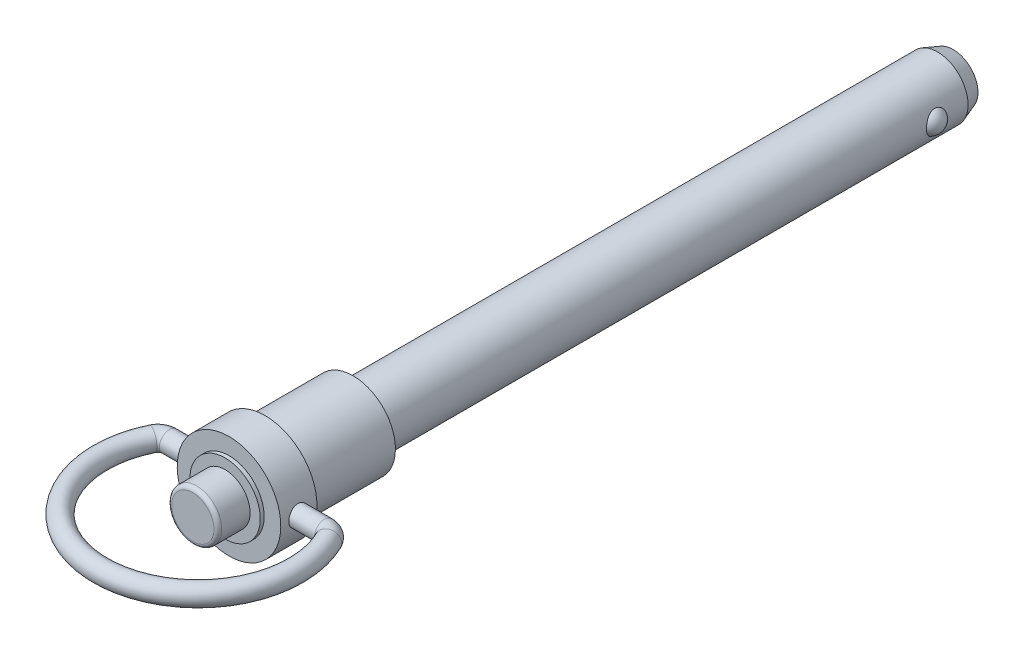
ISO-10303-21;
HEADER;
FILE_DESCRIPTION(('STEP AP214'),'2;1');
FILE_NAME('part.step','',(''),(''),'','','');
FILE_SCHEMA(('AUTOMOTIVE_DESIGN { 1 0 10303 214 1 1 1 1 }'));
ENDSEC;
DATA;
#1=APPLICATION_CONTEXT('core data for automotive mechanical design processes');
#2=APPLICATION_PROTOCOL_DEFINITION('international standard','automotive_design',2000,#1);
#3=PRODUCT_CONTEXT('',#1,'mechanical');
#4=PRODUCT('Part','Part','',(#3));
#5=PRODUCT_RELATED_PRODUCT_CATEGORY('part','',(#4));
#6=PRODUCT_DEFINITION_FORMATION('','',#4);
#7=PRODUCT_DEFINITION_CONTEXT('part definition',#1,'design');
#8=PRODUCT_DEFINITION('design','',#6,#7);
#9=PRODUCT_DEFINITION_SHAPE('','',#8);
#10=(LENGTH_UNIT() NAMED_UNIT(*) SI_UNIT(.MILLI.,.METRE.));
#11=(NAMED_UNIT(*) PLANE_ANGLE_UNIT() SI_UNIT($,.RADIAN.));
#12=(NAMED_UNIT(*) SI_UNIT($,.STERADIAN.) SOLID_ANGLE_UNIT());
#13=UNCERTAINTY_MEASURE_WITH_UNIT(LENGTH_MEASURE(1.E-05),#10,'distance_accuracy_value','');
#14=(GEOMETRIC_REPRESENTATION_CONTEXT(3) GLOBAL_UNCERTAINTY_ASSIGNED_CONTEXT((#13)) GLOBAL_UNIT_ASSIGNED_CONTEXT((#10,
#11,#12)) REPRESENTATION_CONTEXT('',''));
#15=CARTESIAN_POINT('',(0.,0.,0.));
#16=DIRECTION('',(0.,0.,1.));
#17=DIRECTION('',(1.,0.,0.));
#18=AXIS2_PLACEMENT_3D('',#15,#16,#17);
#19=CARTESIAN_POINT('',(0.,0.,20.828));
#20=DIRECTION('',(0.,0.,1.));
#21=DIRECTION('',(0.,-1.,0.));
#22=AXIS2_PLACEMENT_3D('',#19,#20,#21);
#23=PLANE('',#22);
#24=CARTESIAN_POINT('',(0.,0.,20.828));
#25=DIRECTION('',(0.,0.,-1.));
#26=DIRECTION('',(0.,1.,0.));
#27=AXIS2_PLACEMENT_3D('',#24,#25,#26);
#28=CIRCLE('',#27,2.7432);
#29=CARTESIAN_POINT('',(0.,2.7432,20.828));
#30=VERTEX_POINT('',#29);
#31=CARTESIAN_POINT('',(0.,-2.7432,20.828));
#32=VERTEX_POINT('',#31);
#33=EDGE_CURVE('E33',#30,#32,#28,.T.);
#34=ORIENTED_EDGE('',*,*,#33,.F.);
#35=CARTESIAN_POINT('',(0.,0.,20.828));
#36=DIRECTION('',(0.,0.,-1.));
#37=DIRECTION('',(0.,-1.,0.));
#38=AXIS2_PLACEMENT_3D('',#35,#36,#37);
#39=CIRCLE('',#38,2.7432);
#40=EDGE_CURVE('E28',#32,#30,#39,.T.);
#41=ORIENTED_EDGE('',*,*,#40,.F.);
#42=EDGE_LOOP('',(#34,#41));
#43=FACE_BOUND('',#42,.T.);
#44=ADVANCED_FACE('F14',(#43),#23,.T.);
#45=CARTESIAN_POINT('',(0.,0.,20.32));
#46=DIRECTION('',(0.,0.,1.));
#47=DIRECTION('',(0.,-1.,0.));
#48=AXIS2_PLACEMENT_3D('',#45,#46,#47);
#49=TOROIDAL_SURFACE('',#48,2.7432,0.508);
#50=ORIENTED_EDGE('',*,*,#40,.T.);
#51=ORIENTED_EDGE('',*,*,#33,.T.);
#52=EDGE_LOOP('',(#50,#51));
#53=FACE_BOUND('',#52,.T.);
#54=CARTESIAN_POINT('',(0.,0.,20.32));
#55=DIRECTION('',(0.,0.,-1.));
#56=DIRECTION('',(0.,1.,0.));
#57=AXIS2_PLACEMENT_3D('',#54,#55,#56);
#58=CIRCLE('',#57,3.2512);
#59=CARTESIAN_POINT('',(0.,3.2512,20.32));
#60=VERTEX_POINT('',#59);
#61=EDGE_CURVE('E50',#60,#60,#58,.T.);
#62=ORIENTED_EDGE('',*,*,#61,.F.);
#63=EDGE_LOOP('',(#62));
#64=FACE_BOUND('',#63,.T.);
#65=ADVANCED_FACE('F39',(#53,#64),#49,.T.);
#66=CARTESIAN_POINT('',(0.,0.,20.828));
#67=DIRECTION('',(0.,0.,-1.));
#68=DIRECTION('',(0.,1.,0.));
#69=AXIS2_PLACEMENT_3D('',#66,#67,#68);
#70=CYLINDRICAL_SURFACE('',#69,3.2512);
#71=CARTESIAN_POINT('',(0.,0.,16.637));
#72=DIRECTION('',(0.,0.,-1.));
#73=DIRECTION('',(0.,1.,0.));
#74=AXIS2_PLACEMENT_3D('',#71,#72,#73);
#75=CIRCLE('',#74,3.2512);
#76=CARTESIAN_POINT('',(0.,3.2512,16.637));
#77=VERTEX_POINT('',#76);
#78=EDGE_CURVE('E59',#77,#77,#75,.T.);
#79=ORIENTED_EDGE('',*,*,#78,.F.);
#80=EDGE_LOOP('',(#79));
#81=FACE_BOUND('',#80,.T.);
#82=ORIENTED_EDGE('',*,*,#61,.T.);
#83=EDGE_LOOP('',(#82));
#84=FACE_BOUND('',#83,.T.);
#85=ADVANCED_FACE('F79',(#81,#84),#70,.T.);
#86=CARTESIAN_POINT('',(4.572,0.,16.637));
#87=DIRECTION('',(0.,0.,1.));
#88=DIRECTION('',(0.,-1.,0.));
#89=AXIS2_PLACEMENT_3D('',#86,#87,#88);
#90=PLANE('',#89);
#91=ORIENTED_EDGE('',*,*,#78,.T.);
#92=EDGE_LOOP('',(#91));
#93=FACE_BOUND('',#92,.T.);
#94=CARTESIAN_POINT('',(0.,0.,16.637));
#95=DIRECTION('',(0.,0.,-1.));
#96=DIRECTION('',(0.,1.,0.));
#97=AXIS2_PLACEMENT_3D('',#94,#95,#96);
#98=CIRCLE('',#97,4.572);
#99=CARTESIAN_POINT('',(0.,4.572,16.637));
#100=VERTEX_POINT('',#99);
#101=EDGE_CURVE('E63',#100,#100,#98,.T.);
#102=ORIENTED_EDGE('',*,*,#101,.F.);
#103=EDGE_LOOP('',(#102));
#104=FACE_BOUND('',#103,.T.);
#105=ADVANCED_FACE('F82',(#93,#104),#90,.T.);
#106=CARTESIAN_POINT('',(0.,0.,0.));
#107=DIRECTION('',(0.,0.,-1.));
#108=DIRECTION('',(0.,1.,0.));
#109=AXIS2_PLACEMENT_3D('',#106,#107,#108);
#110=CYLINDRICAL_SURFACE('',#109,4.572);
#111=ORIENTED_EDGE('',*,*,#101,.T.);
#112=EDGE_LOOP('',(#111));
#113=FACE_BOUND('',#112,.T.);
#114=CARTESIAN_POINT('',(0.,0.,16.129));
#115=DIRECTION('',(0.,0.,-1.));
#116=DIRECTION('',(0.,1.,0.));
#117=AXIS2_PLACEMENT_3D('',#114,#115,#116);
#118=CIRCLE('',#117,4.572);
#119=CARTESIAN_POINT('',(0.,4.572,16.129));
#120=VERTEX_POINT('',#119);
#121=EDGE_CURVE('E217',#120,#120,#118,.T.);
#122=ORIENTED_EDGE('',*,*,#121,.F.);
#123=EDGE_LOOP('',(#122));
#124=FACE_BOUND('',#123,.T.);
#125=ADVANCED_FACE('F181',(#113,#124),#110,.T.);
#126=CARTESIAN_POINT('',(6.731,0.,16.129));
#127=DIRECTION('',(0.,0.,1.));
#128=DIRECTION('',(0.,-1.,0.));
#129=AXIS2_PLACEMENT_3D('',#126,#127,#128);
#130=PLANE('',#129);
#131=CARTESIAN_POINT('',(0.,0.,16.129));
#132=DIRECTION('',(0.,0.,-1.));
#133=DIRECTION('',(0.,1.,0.));
#134=AXIS2_PLACEMENT_3D('',#131,#132,#133);
#135=CIRCLE('',#134,6.731);
#136=CARTESIAN_POINT('',(0.,6.731,16.129));
#137=VERTEX_POINT('',#136);
#138=EDGE_CURVE('E220',#137,#137,#135,.T.);
#139=ORIENTED_EDGE('',*,*,#138,.F.);
#140=EDGE_LOOP('',(#139));
#141=FACE_BOUND('',#140,.T.);
#142=ORIENTED_EDGE('',*,*,#121,.T.);
#143=EDGE_LOOP('',(#142));
#144=FACE_BOUND('',#143,.T.);
#145=ADVANCED_FACE('F170',(#141,#144),#130,.T.);
#146=CARTESIAN_POINT('',(0.,0.,0.));
#147=DIRECTION('',(0.,0.,-1.));
#148=DIRECTION('',(0.,1.,0.));
#149=AXIS2_PLACEMENT_3D('',#146,#147,#148);
#150=CYLINDRICAL_SURFACE('',#149,6.731);
#151=CARTESIAN_POINT('',(0.,0.,11.43));
#152=DIRECTION('',(0.,0.,-1.));
#153=DIRECTION('',(0.,1.,0.));
#154=AXIS2_PLACEMENT_3D('',#151,#152,#153);
#155=CIRCLE('',#154,6.731);
#156=CARTESIAN_POINT('',(0.,6.731,11.43));
#157=VERTEX_POINT('',#156);
#158=EDGE_CURVE('E222',#157,#157,#155,.T.);
#159=ORIENTED_EDGE('',*,*,#158,.F.);
#160=EDGE_LOOP('',(#159));
#161=FACE_BOUND('',#160,.T.);
#162=ORIENTED_EDGE('',*,*,#138,.T.);
#163=EDGE_LOOP('',(#162));
#164=FACE_BOUND('',#163,.T.);
#165=CARTESIAN_POINT('',(-6.6051722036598,1.2954,13.7922));
#166=CARTESIAN_POINT('',(-6.60517361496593,1.2953972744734,13.864236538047));
#167=CARTESIAN_POINT('',(-6.60636346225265,1.28937073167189,13.9363080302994));
#168=CARTESIAN_POINT('',(-6.61098794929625,1.26544153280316,14.0784162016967));
#169=CARTESIAN_POINT('',(-6.61442445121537,1.24752902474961,14.1484511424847));
#170=CARTESIAN_POINT('',(-6.62313895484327,1.20040052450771,14.2844095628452));
#171=CARTESIAN_POINT('',(-6.62841519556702,1.17119533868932,14.3503369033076));
#172=CARTESIAN_POINT('',(-6.64021258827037,1.10233951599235,14.4763528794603));
#173=CARTESIAN_POINT('',(-6.64673365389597,1.06268960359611,14.5364419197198));
#174=CARTESIAN_POINT('',(-6.66038139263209,0.973516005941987,14.6498669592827));
#175=CARTESIAN_POINT('',(-6.66751428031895,0.9238817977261,14.7031153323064));
#176=CARTESIAN_POINT('',(-6.68152715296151,0.816387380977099,14.8005834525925));
#177=CARTESIAN_POINT('',(-6.6884071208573,0.758526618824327,14.8448025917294));
#178=CARTESIAN_POINT('',(-6.7012057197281,0.635644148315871,14.9232944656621));
#179=CARTESIAN_POINT('',(-6.70711617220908,0.570568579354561,14.9574843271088));
#180=CARTESIAN_POINT('',(-6.71724013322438,0.435464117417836,15.014412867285));
#181=CARTESIAN_POINT('',(-6.72145378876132,0.365435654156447,15.0371525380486));
#182=CARTESIAN_POINT('',(-6.72766549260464,0.223321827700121,15.0702635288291));
#183=CARTESIAN_POINT('',(-6.72968999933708,0.151272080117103,15.0807826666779));
#184=CARTESIAN_POINT('',(-6.73138656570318,0.00640388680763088,15.089614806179));
#185=CARTESIAN_POINT('',(-6.73105883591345,-0.0664144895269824,15.0879289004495));
#186=CARTESIAN_POINT('',(-6.72810846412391,-0.209738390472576,15.072511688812));
#187=CARTESIAN_POINT('',(-6.72551615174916,-0.280261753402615,15.0589395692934));
#188=CARTESIAN_POINT('',(-6.71836197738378,-0.418011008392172,15.0203872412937));
#189=CARTESIAN_POINT('',(-6.71380004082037,-0.485236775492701,14.9954066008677));
#190=CARTESIAN_POINT('',(-6.70316878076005,-0.614941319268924,14.9345963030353));
#191=CARTESIAN_POINT('',(-6.69709072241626,-0.67738974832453,14.8987035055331));
#192=CARTESIAN_POINT('',(-6.68409856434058,-0.795436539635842,14.8171343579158));
#193=CARTESIAN_POINT('',(-6.677184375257,-0.851034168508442,14.7714569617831));
#194=CARTESIAN_POINT('',(-6.66315320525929,-0.954744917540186,14.6707395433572));
#195=CARTESIAN_POINT('',(-6.65603475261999,-1.00272266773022,14.6155602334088));
#196=CARTESIAN_POINT('',(-6.64250376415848,-1.08876420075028,14.4978679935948));
#197=CARTESIAN_POINT('',(-6.63609123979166,-1.12682782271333,14.4353549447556));
#198=CARTESIAN_POINT('',(-6.62469571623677,-1.19200234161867,14.3045844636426));
#199=CARTESIAN_POINT('',(-6.61971540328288,-1.21909269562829,14.2363165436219));
#200=CARTESIAN_POINT('',(-6.61178862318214,-1.26138008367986,14.0960804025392));
#201=CARTESIAN_POINT('',(-6.60884191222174,-1.27657854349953,14.0241126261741));
#202=CARTESIAN_POINT('',(-6.60536444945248,-1.29445125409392,13.8797427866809));
#203=CARTESIAN_POINT('',(-6.60479610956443,-1.29732037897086,13.8073657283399));
#204=CARTESIAN_POINT('',(-6.60603903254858,-1.29097613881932,13.6631669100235));
#205=CARTESIAN_POINT('',(-6.60785017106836,-1.28176340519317,13.5913451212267));
#206=CARTESIAN_POINT('',(-6.6136128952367,-1.25168453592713,13.4509418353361));
#207=CARTESIAN_POINT('',(-6.61754556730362,-1.23092132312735,13.3823374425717));
#208=CARTESIAN_POINT('',(-6.62709183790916,-1.17844042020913,13.249581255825));
#209=CARTESIAN_POINT('',(-6.63270556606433,-1.14672188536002,13.1854298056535));
#210=CARTESIAN_POINT('',(-6.6450665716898,-1.07278507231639,13.0625442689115));
#211=CARTESIAN_POINT('',(-6.65182676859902,-1.03044414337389,13.0038853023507));
#212=CARTESIAN_POINT('',(-6.66568301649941,-0.936629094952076,12.8944341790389));
#213=CARTESIAN_POINT('',(-6.67277909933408,-0.885154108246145,12.8436427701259));
#214=CARTESIAN_POINT('',(-6.68662882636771,-0.773660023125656,12.7506362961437));
#215=CARTESIAN_POINT('',(-6.69337621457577,-0.713530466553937,12.7085525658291));
#216=CARTESIAN_POINT('',(-6.70566168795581,-0.586941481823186,12.6350847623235));
#217=CARTESIAN_POINT('',(-6.71119982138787,-0.520482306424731,12.6037002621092));
#218=CARTESIAN_POINT('',(-6.72041595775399,-0.383476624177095,12.5527164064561));
#219=CARTESIAN_POINT('',(-6.72410395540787,-0.312954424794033,12.5330536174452));
#220=CARTESIAN_POINT('',(-6.72924701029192,-0.169530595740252,12.5058694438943));
#221=CARTESIAN_POINT('',(-6.7307023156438,-0.0966292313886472,12.4983467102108));
#222=CARTESIAN_POINT('',(-6.73121071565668,0.0482259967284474,12.4957052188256));
#223=CARTESIAN_POINT('',(-6.73030215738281,0.120176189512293,12.5003884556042));
#224=CARTESIAN_POINT('',(-6.72626496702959,0.26224403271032,12.5215909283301));
#225=CARTESIAN_POINT('',(-6.72313635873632,0.332361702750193,12.5381100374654));
#226=CARTESIAN_POINT('',(-6.71501101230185,0.468662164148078,12.5824301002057));
#227=CARTESIAN_POINT('',(-6.710017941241,0.534852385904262,12.6102089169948));
#228=CARTESIAN_POINT('',(-6.69870305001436,0.661661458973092,12.6762356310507));
#229=CARTESIAN_POINT('',(-6.69238113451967,0.722279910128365,12.7144842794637));
#230=CARTESIAN_POINT('',(-6.6789853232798,0.837208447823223,12.8010411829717));
#231=CARTESIAN_POINT('',(-6.67190155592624,0.891410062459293,12.8494919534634));
#232=CARTESIAN_POINT('',(-6.65784127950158,0.990982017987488,12.95478313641));
#233=CARTESIAN_POINT('',(-6.65086479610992,1.03635027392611,13.0116255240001));
#234=CARTESIAN_POINT('',(-6.63773378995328,1.11738877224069,13.1327559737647));
#235=CARTESIAN_POINT('',(-6.63158802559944,1.15295925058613,13.1971117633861));
#236=CARTESIAN_POINT('',(-6.62092027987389,1.21272619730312,13.3309847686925));
#237=CARTESIAN_POINT('',(-6.61639678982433,1.23693323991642,13.4004971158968));
#238=CARTESIAN_POINT('',(-6.61041337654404,1.26845390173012,13.5238636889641));
#239=CARTESIAN_POINT('',(-6.60845980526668,1.27854107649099,13.57700269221));
#240=CARTESIAN_POINT('',(-6.60583870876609,1.29201504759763,13.6841545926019));
#241=CARTESIAN_POINT('',(-6.60517114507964,1.29540204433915,13.7381674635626));
#242=CARTESIAN_POINT('',(-6.6051722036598,1.2954,13.7922));
#243=B_SPLINE_CURVE_WITH_KNOTS('',3,(#165,#166,#167,#168,#169,#170,#171,#172,#173,#174,#175,
#176,#177,#178,#179,#180,#181,#182,#183,#184,#185,#186,#187,#188,#189,#190,#191,#192,#193,#194,
#195,#196,#197,#198,#199,#200,#201,#202,#203,#204,#205,#206,#207,#208,#209,#210,#211,#212,#213,
#214,#215,#216,#217,#218,#219,#220,#221,#222,#223,#224,#225,#226,#227,#228,#229,#230,#231,#232,
#233,#234,#235,#236,#237,#238,#239,#240,#241,#242),.UNSPECIFIED.,.T.,.F.,(4,2,2,2,2,2,2,2,2,2,2,
2,2,2,2,2,2,2,2,2,2,2,2,2,2,2,2,2,2,2,2,2,2,2,2,2,2,2,4),(0.,0.215911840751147,
0.432002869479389,0.64788762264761,0.86375740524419,1.08216318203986,1.30058366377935,
1.52076118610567,1.74091962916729,1.95838638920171,2.1758336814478,2.39041258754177,
2.60499961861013,2.82085272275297,3.0367289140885,3.25609136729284,3.47545737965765,
3.69523218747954,3.91498064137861,4.13124273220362,4.34749352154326,4.56184753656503,
4.7762180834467,4.99318797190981,5.21017847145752,5.430235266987,5.65028327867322,
5.86912939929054,6.08795119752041,6.30324544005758,6.51853737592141,6.73340808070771,
6.94829420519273,7.16640910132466,7.38457541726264,7.60488731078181,7.82499378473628,
7.9869478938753,8.14889715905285),.UNSPECIFIED.);
#244=CARTESIAN_POINT('',(-6.6051722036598,1.2954,13.7922));
#245=VERTEX_POINT('',#244);
#246=EDGE_CURVE('E191',#245,#245,#243,.T.);
#247=ORIENTED_EDGE('',*,*,#246,.T.);
#248=EDGE_LOOP('',(#247));
#249=FACE_BOUND('',#248,.T.);
#250=CARTESIAN_POINT('',(6.6051722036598,1.2954,13.7922));
#251=CARTESIAN_POINT('',(6.60517361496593,1.2953972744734,13.720163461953));
#252=CARTESIAN_POINT('',(6.60636346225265,1.2893707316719,13.6480919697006));
#253=CARTESIAN_POINT('',(6.61098794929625,1.26544153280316,13.5059837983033));
#254=CARTESIAN_POINT('',(6.61442445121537,1.24752902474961,13.4359488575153));
#255=CARTESIAN_POINT('',(6.62313895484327,1.20040052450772,13.2999904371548));
#256=CARTESIAN_POINT('',(6.62841519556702,1.17119533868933,13.2340630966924));
#257=CARTESIAN_POINT('',(6.64021258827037,1.10233951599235,13.1080471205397));
#258=CARTESIAN_POINT('',(6.64673365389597,1.06268960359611,13.0479580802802));
#259=CARTESIAN_POINT('',(6.66038139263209,0.973516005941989,12.9345330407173));
#260=CARTESIAN_POINT('',(6.66751428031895,0.923881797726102,12.8812846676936));
#261=CARTESIAN_POINT('',(6.68152715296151,0.816387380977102,12.7838165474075));
#262=CARTESIAN_POINT('',(6.6884071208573,0.758526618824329,12.7395974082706));
#263=CARTESIAN_POINT('',(6.7012057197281,0.635644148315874,12.6611055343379));
#264=CARTESIAN_POINT('',(6.70711617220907,0.570568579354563,12.6269156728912));
#265=CARTESIAN_POINT('',(6.71724013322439,0.435464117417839,12.569987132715));
#266=CARTESIAN_POINT('',(6.72145378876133,0.36543565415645,12.5472474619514));
#267=CARTESIAN_POINT('',(6.72766549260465,0.223321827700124,12.5141364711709));
#268=CARTESIAN_POINT('',(6.72968999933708,0.151272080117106,12.5036173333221));
#269=CARTESIAN_POINT('',(6.73138656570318,0.00640388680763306,12.494785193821));
#270=CARTESIAN_POINT('',(6.73105883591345,-0.0664144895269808,12.4964710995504));
#271=CARTESIAN_POINT('',(6.72810846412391,-0.209738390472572,12.511888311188));
#272=CARTESIAN_POINT('',(6.72551615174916,-0.280261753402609,12.5254604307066));
#273=CARTESIAN_POINT('',(6.71836197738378,-0.418011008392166,12.5640127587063));
#274=CARTESIAN_POINT('',(6.71380004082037,-0.4852367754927,12.5889933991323));
#275=CARTESIAN_POINT('',(6.70316878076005,-0.614941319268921,12.6498036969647));
#276=CARTESIAN_POINT('',(6.69709072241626,-0.67738974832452,12.6856964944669));
#277=CARTESIAN_POINT('',(6.68409856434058,-0.795436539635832,12.7672656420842));
#278=CARTESIAN_POINT('',(6.677184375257,-0.851034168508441,12.8129430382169));
#279=CARTESIAN_POINT('',(6.66315320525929,-0.954744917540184,12.9136604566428));
#280=CARTESIAN_POINT('',(6.65603475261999,-1.00272266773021,12.9688397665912));
#281=CARTESIAN_POINT('',(6.64250376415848,-1.08876420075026,13.0865320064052));
#282=CARTESIAN_POINT('',(6.63609123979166,-1.12682782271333,13.1490450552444));
#283=CARTESIAN_POINT('',(6.62469571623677,-1.19200234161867,13.2798155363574));
#284=CARTESIAN_POINT('',(6.61971540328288,-1.21909269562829,13.3480834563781));
#285=CARTESIAN_POINT('',(6.61178862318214,-1.26138008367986,13.4883195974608));
#286=CARTESIAN_POINT('',(6.60884191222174,-1.27657854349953,13.5602873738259));
#287=CARTESIAN_POINT('',(6.60536444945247,-1.29445125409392,13.7046572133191));
#288=CARTESIAN_POINT('',(6.60479610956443,-1.29732037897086,13.7770342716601));
#289=CARTESIAN_POINT('',(6.60603903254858,-1.29097613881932,13.9212330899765));
#290=CARTESIAN_POINT('',(6.60785017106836,-1.28176340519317,13.9930548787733));
#291=CARTESIAN_POINT('',(6.6136128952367,-1.25168453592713,14.1334581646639));
#292=CARTESIAN_POINT('',(6.61754556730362,-1.23092132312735,14.2020625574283));
#293=CARTESIAN_POINT('',(6.62709183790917,-1.17844042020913,14.334818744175));
#294=CARTESIAN_POINT('',(6.63270556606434,-1.14672188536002,14.3989701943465));
#295=CARTESIAN_POINT('',(6.64506657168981,-1.07278507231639,14.5218557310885));
#296=CARTESIAN_POINT('',(6.65182676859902,-1.03044414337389,14.5805146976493));
#297=CARTESIAN_POINT('',(6.66568301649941,-0.936629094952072,14.6899658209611));
#298=CARTESIAN_POINT('',(6.67277909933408,-0.885154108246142,14.7407572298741));
#299=CARTESIAN_POINT('',(6.68662882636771,-0.773660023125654,14.8337637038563));
#300=CARTESIAN_POINT('',(6.69337621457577,-0.713530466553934,14.8758474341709));
#301=CARTESIAN_POINT('',(6.70566168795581,-0.586941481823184,14.9493152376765));
#302=CARTESIAN_POINT('',(6.71119982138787,-0.520482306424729,14.9806997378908));
#303=CARTESIAN_POINT('',(6.72041595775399,-0.383476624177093,15.0316835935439));
#304=CARTESIAN_POINT('',(6.72410395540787,-0.31295442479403,15.0513463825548));
#305=CARTESIAN_POINT('',(6.72924701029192,-0.169530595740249,15.0785305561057));
#306=CARTESIAN_POINT('',(6.7307023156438,-0.0966292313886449,15.0860532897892));
#307=CARTESIAN_POINT('',(6.73121071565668,0.0482259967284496,15.0886947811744));
#308=CARTESIAN_POINT('',(6.73030215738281,0.120176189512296,15.0840115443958));
#309=CARTESIAN_POINT('',(6.72626496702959,0.262244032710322,15.0628090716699));
#310=CARTESIAN_POINT('',(6.72313635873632,0.332361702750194,15.0462899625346));
#311=CARTESIAN_POINT('',(6.71501101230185,0.46866216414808,15.0019698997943));
#312=CARTESIAN_POINT('',(6.710017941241,0.534852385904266,14.9741910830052));
#313=CARTESIAN_POINT('',(6.69870305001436,0.661661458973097,14.9081643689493));
#314=CARTESIAN_POINT('',(6.69238113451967,0.722279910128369,14.8699157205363));
#315=CARTESIAN_POINT('',(6.6789853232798,0.837208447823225,14.7833588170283));
#316=CARTESIAN_POINT('',(6.67190155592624,0.891410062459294,14.7349080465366));
#317=CARTESIAN_POINT('',(6.65784127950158,0.990982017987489,14.62961686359));
#318=CARTESIAN_POINT('',(6.65086479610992,1.03635027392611,14.5727744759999));
#319=CARTESIAN_POINT('',(6.63773378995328,1.1173887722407,14.4516440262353));
#320=CARTESIAN_POINT('',(6.63158802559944,1.15295925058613,14.3872882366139));
#321=CARTESIAN_POINT('',(6.62092027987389,1.21272619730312,14.2534152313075));
#322=CARTESIAN_POINT('',(6.61639678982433,1.23693323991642,14.1839028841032));
#323=CARTESIAN_POINT('',(6.61041337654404,1.26845390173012,14.0605363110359));
#324=CARTESIAN_POINT('',(6.60845980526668,1.27854107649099,14.00739730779));
#325=CARTESIAN_POINT('',(6.60583870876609,1.29201504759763,13.9002454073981));
#326=CARTESIAN_POINT('',(6.60517114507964,1.29540204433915,13.8462325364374));
#327=CARTESIAN_POINT('',(6.6051722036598,1.2954,13.7922));
#328=B_SPLINE_CURVE_WITH_KNOTS('',3,(#250,#251,#252,#253,#254,#255,#256,#257,#258,#259,#260,
#261,#262,#263,#264,#265,#266,#267,#268,#269,#270,#271,#272,#273,#274,#275,#276,#277,#278,#279,
#280,#281,#282,#283,#284,#285,#286,#287,#288,#289,#290,#291,#292,#293,#294,#295,#296,#297,#298,
#299,#300,#301,#302,#303,#304,#305,#306,#307,#308,#309,#310,#311,#312,#313,#314,#315,#316,#317,
#318,#319,#320,#321,#322,#323,#324,#325,#326,#327),.UNSPECIFIED.,.T.,.F.,(4,2,2,2,2,2,2,2,2,2,2,
2,2,2,2,2,2,2,2,2,2,2,2,2,2,2,2,2,2,2,2,2,2,2,2,2,2,2,4),(0.,0.215911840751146,
0.432002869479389,0.64788762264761,0.86375740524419,1.08216318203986,1.30058366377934,
1.52076118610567,1.74091962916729,1.95838638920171,2.1758336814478,2.39041258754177,
2.60499961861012,2.82085272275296,3.0367289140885,3.25609136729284,3.47545737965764,
3.69523218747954,3.91498064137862,4.13124273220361,4.34749352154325,4.56184753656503,
4.77621808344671,4.99318797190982,5.21017847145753,5.43023526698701,5.65028327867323,
5.86912939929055,6.08795119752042,6.30324544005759,6.51853737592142,6.73340808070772,
6.94829420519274,7.16640910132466,7.38457541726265,7.60488731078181,7.82499378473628,
7.98694789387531,8.14889715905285),.UNSPECIFIED.);
#329=CARTESIAN_POINT('',(6.6051722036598,1.2954,13.7922));
#330=VERTEX_POINT('',#329);
#331=EDGE_CURVE('E198',#330,#330,#328,.T.);
#332=ORIENTED_EDGE('',*,*,#331,.T.);
#333=EDGE_LOOP('',(#332));
#334=FACE_BOUND('',#333,.T.);
#335=ADVANCED_FACE('F164',(#161,#164,#249,#334),#150,.T.);
#336=CARTESIAN_POINT('',(5.7785,0.,11.43));
#337=DIRECTION('',(0.,0.,-1.));
#338=DIRECTION('',(0.,1.,0.));
#339=AXIS2_PLACEMENT_3D('',#336,#337,#338);
#340=PLANE('',#339);
#341=CARTESIAN_POINT('',(0.,0.,11.43));
#342=DIRECTION('',(0.,0.,-1.));
#343=DIRECTION('',(0.,1.,0.));
#344=AXIS2_PLACEMENT_3D('',#341,#342,#343);
#345=CIRCLE('',#344,5.9);
#346=CARTESIAN_POINT('',(0.,5.9,11.43));
#347=VERTEX_POINT('',#346);
#348=EDGE_CURVE('E22',#347,#347,#345,.F.);
#349=ORIENTED_EDGE('',*,*,#348,.T.);
#350=EDGE_LOOP('',(#349));
#351=FACE_BOUND('',#350,.T.);
#352=ORIENTED_EDGE('',*,*,#158,.T.);
#353=EDGE_LOOP('',(#352));
#354=FACE_BOUND('',#353,.T.);
#355=ADVANCED_FACE('F87',(#351,#354),#340,.T.);
#356=CARTESIAN_POINT('',(10.0803124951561,0.,15.3162));
#357=DIRECTION('',(0.,1.,0.));
#358=DIRECTION('',(-1.,0.,0.));
#359=AXIS2_PLACEMENT_3D('',#356,#357,#358);
#360=TOROIDAL_SURFACE('',#359,1.524,1.2954);
#361=CARTESIAN_POINT('',(11.4549005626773,0.,14.658109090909));
#362=DIRECTION('',(-0.431818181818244,0.,-0.901960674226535));
#363=DIRECTION('',(0.901960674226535,0.,-0.431818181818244));
#364=AXIS2_PLACEMENT_3D('',#361,#362,#363);
#365=CIRCLE('',#364,1.2954);
#366=CARTESIAN_POINT('',(12.6233004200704,0.,14.0987318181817));
#367=VERTEX_POINT('',#366);
#368=EDGE_CURVE('E41',#367,#367,#365,.T.);
#369=ORIENTED_EDGE('',*,*,#368,.T.);
#370=EDGE_LOOP('',(#369));
#371=FACE_BOUND('',#370,.T.);
#372=CARTESIAN_POINT('',(10.0803124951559,0.,13.7922));
#373=DIRECTION('',(1.,0.,0.));
#374=DIRECTION('',(0.,1.,0.));
#375=AXIS2_PLACEMENT_3D('',#372,#373,#374);
#376=CIRCLE('',#375,1.2954);
#377=CARTESIAN_POINT('',(10.0803124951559,1.2954,13.7922));
#378=VERTEX_POINT('',#377);
#379=EDGE_CURVE('E56',#378,#378,#376,.F.);
#380=ORIENTED_EDGE('',*,*,#379,.F.);
#381=EDGE_LOOP('',(#380));
#382=FACE_BOUND('',#381,.T.);
#383=ADVANCED_FACE('F84',(#371,#382),#360,.T.);
#384=CARTESIAN_POINT('',(-10.0803124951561,0.,13.7922));
#385=DIRECTION('',(1.,0.,0.));
#386=DIRECTION('',(0.,1.,0.));
#387=AXIS2_PLACEMENT_3D('',#384,#385,#386);
#388=CYLINDRICAL_SURFACE('',#387,1.2954);
#389=ORIENTED_EDGE('',*,*,#331,.F.);
#390=EDGE_LOOP('',(#389));
#391=FACE_BOUND('',#390,.T.);
#392=ORIENTED_EDGE('',*,*,#379,.T.);
#393=EDGE_LOOP('',(#392));
#394=FACE_BOUND('',#393,.T.);
#395=ADVANCED_FACE('F76',(#391,#394),#388,.T.);
#396=CARTESIAN_POINT('',(0.,0.,20.1422));
#397=DIRECTION('',(0.,1.,0.));
#398=DIRECTION('',(-1.,0.,0.));
#399=AXIS2_PLACEMENT_3D('',#396,#397,#398);
#400=TOROIDAL_SURFACE('',#399,12.7,1.2954);
#401=CARTESIAN_POINT('',(-11.4549005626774,0.,14.6581090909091));
#402=DIRECTION('',(-0.43181818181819,0.,0.901960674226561));
#403=DIRECTION('',(-0.901960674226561,0.,-0.43181818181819));
#404=AXIS2_PLACEMENT_3D('',#401,#402,#403);
#405=CIRCLE('',#404,1.2954);
#406=CARTESIAN_POINT('',(-12.6233004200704,0.,14.0987318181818));
#407=VERTEX_POINT('',#406);
#408=EDGE_CURVE('E53',#407,#407,#405,.F.);
#409=ORIENTED_EDGE('',*,*,#408,.F.);
#410=EDGE_LOOP('',(#409));
#411=FACE_BOUND('',#410,.T.);
#412=ORIENTED_EDGE('',*,*,#368,.F.);
#413=EDGE_LOOP('',(#412));
#414=FACE_BOUND('',#413,.T.);
#415=ADVANCED_FACE('F74',(#411,#414),#400,.T.);
#416=CARTESIAN_POINT('',(-10.0803124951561,0.,15.3162));
#417=DIRECTION('',(0.,1.,0.));
#418=DIRECTION('',(-1.,0.,0.));
#419=AXIS2_PLACEMENT_3D('',#416,#417,#418);
#420=TOROIDAL_SURFACE('',#419,1.524,1.2954);
#421=CARTESIAN_POINT('',(-10.0803124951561,0.,13.7922));
#422=DIRECTION('',(1.,0.,0.));
#423=DIRECTION('',(0.,1.,0.));
#424=AXIS2_PLACEMENT_3D('',#421,#422,#423);
#425=CIRCLE('',#424,1.2954);
#426=CARTESIAN_POINT('',(-10.0803124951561,1.2954,13.7922));
#427=VERTEX_POINT('',#426);
#428=EDGE_CURVE('E60',#427,#427,#425,.T.);
#429=ORIENTED_EDGE('',*,*,#428,.F.);
#430=EDGE_LOOP('',(#429));
#431=FACE_BOUND('',#430,.T.);
#432=ORIENTED_EDGE('',*,*,#408,.T.);
#433=EDGE_LOOP('',(#432));
#434=FACE_BOUND('',#433,.T.);
#435=ADVANCED_FACE('F69',(#431,#434),#420,.T.);
#436=CARTESIAN_POINT('',(-10.0803124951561,0.,13.7922));
#437=DIRECTION('',(1.,0.,0.));
#438=DIRECTION('',(0.,1.,0.));
#439=AXIS2_PLACEMENT_3D('',#436,#437,#438);
#440=CYLINDRICAL_SURFACE('',#439,1.2954);
#441=ORIENTED_EDGE('',*,*,#246,.F.);
#442=EDGE_LOOP('',(#441));
#443=FACE_BOUND('',#442,.T.);
#444=ORIENTED_EDGE('',*,*,#428,.T.);
#445=EDGE_LOOP('',(#444));
#446=FACE_BOUND('',#445,.T.);
#447=ADVANCED_FACE('F73',(#443,#446),#440,.T.);
#448=CARTESIAN_POINT('',(0.,0.,39.7572114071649));
#449=DIRECTION('',(0.,0.,-1.));
#450=DIRECTION('',(0.,1.,0.));
#451=AXIS2_PLACEMENT_3D('',#448,#449,#450);
#452=CYLINDRICAL_SURFACE('',#451,5.5);
#453=CARTESIAN_POINT('',(0.,0.,11.03));
#454=DIRECTION('',(0.,0.,-1.));
#455=DIRECTION('',(0.,1.,0.));
#456=AXIS2_PLACEMENT_3D('',#453,#454,#455);
#457=CIRCLE('',#456,5.5);
#458=CARTESIAN_POINT('',(0.,5.5,11.03));
#459=VERTEX_POINT('',#458);
#460=EDGE_CURVE('E9',#459,#459,#457,.T.);
#461=ORIENTED_EDGE('',*,*,#460,.T.);
#462=EDGE_LOOP('',(#461));
#463=FACE_BOUND('',#462,.T.);
#464=CARTESIAN_POINT('',(0.,0.,0.));
#465=DIRECTION('',(0.,0.,-1.));
#466=DIRECTION('',(0.,1.,0.));
#467=AXIS2_PLACEMENT_3D('',#464,#465,#466);
#468=CIRCLE('',#467,5.5);
#469=CARTESIAN_POINT('',(0.,5.5,0.));
#470=VERTEX_POINT('',#469);
#471=EDGE_CURVE('E199',#470,#470,#468,.T.);
#472=ORIENTED_EDGE('',*,*,#471,.F.);
#473=EDGE_LOOP('',(#472));
#474=FACE_BOUND('',#473,.T.);
#475=ADVANCED_FACE('F188',(#463,#474),#452,.T.);
#476=CARTESIAN_POINT('',(3.22979748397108,0.,-77.9908));
#477=DIRECTION('',(0.,0.,1.));
#478=DIRECTION('',(0.,-1.,0.));
#479=AXIS2_PLACEMENT_3D('',#476,#477,#478);
#480=PLANE('',#479);
#481=CARTESIAN_POINT('',(0.,0.,-77.9907999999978));
#482=DIRECTION('',(0.,0.,1.));
#483=DIRECTION('',(0.,-1.,0.));
#484=AXIS2_PLACEMENT_3D('',#481,#482,#483);
#485=CIRCLE('',#484,3.22979748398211);
#486=CARTESIAN_POINT('',(0.,-3.22979748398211,-77.9907999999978));
#487=VERTEX_POINT('',#486);
#488=EDGE_CURVE('E119',#487,#487,#485,.T.);
#489=ORIENTED_EDGE('',*,*,#488,.F.);
#490=EDGE_LOOP('',(#489));
#491=FACE_BOUND('',#490,.T.);
#492=ADVANCED_FACE('F130',(#491),#480,.F.);
#493=CARTESIAN_POINT('',(3.12293,0.,-71.8948));
#494=DIRECTION('',(0.,0.,1.));
#495=DIRECTION('',(1.,0.,0.));
#496=AXIS2_PLACEMENT_3D('',#493,#494,#495);
#497=SPHERICAL_SURFACE('',#496,1.5875);
#498=CARTESIAN_POINT('',(3.969385,0.,-70.5517921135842));
#499=CARTESIAN_POINT('',(3.96938133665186,0.0871787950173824,-70.5517940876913));
#500=CARTESIAN_POINT('',(3.96648576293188,0.174428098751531,-70.5584820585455));
#501=CARTESIAN_POINT('',(3.95516905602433,0.346584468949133,-70.5851998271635));
#502=CARTESIAN_POINT('',(3.94674017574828,0.431488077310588,-70.6052483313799));
#503=CARTESIAN_POINT('',(3.92519423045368,0.596479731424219,-70.6585272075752));
#504=CARTESIAN_POINT('',(3.91207555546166,0.676566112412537,-70.6917621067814));
#505=CARTESIAN_POINT('',(3.88253654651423,0.829452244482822,-70.7710588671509));
#506=CARTESIAN_POINT('',(3.86611699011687,0.902253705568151,-70.8171177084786));
#507=CARTESIAN_POINT('',(3.83222363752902,1.03672093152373,-70.9203356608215));
#508=CARTESIAN_POINT('',(3.81477966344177,1.0985904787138,-70.9772380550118));
#509=CARTESIAN_POINT('',(3.78068495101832,1.21073548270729,-71.1017462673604));
#510=CARTESIAN_POINT('',(3.76403384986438,1.26101628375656,-71.1693471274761));
#511=CARTESIAN_POINT('',(3.73507217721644,1.34426479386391,-71.3077911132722));
#512=CARTESIAN_POINT('',(3.72252093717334,1.37829571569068,-71.3779422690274));
#513=CARTESIAN_POINT('',(3.70178973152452,1.43305274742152,-71.5238520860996));
#514=CARTESIAN_POINT('',(3.69360549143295,1.45379187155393,-71.5996051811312));
#515=CARTESIAN_POINT('',(3.68341966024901,1.47939277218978,-71.7454817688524));
#516=CARTESIAN_POINT('',(3.680835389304,1.4857542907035,-71.8153038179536));
#517=CARTESIAN_POINT('',(3.68040725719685,1.48681628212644,-71.9550414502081));
#518=CARTESIAN_POINT('',(3.68256179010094,1.48152070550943,-72.0249569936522));
#519=CARTESIAN_POINT('',(3.69108766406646,1.4601393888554,-72.1588086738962));
#520=CARTESIAN_POINT('',(3.69721728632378,1.44467149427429,-72.2228608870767));
#521=CARTESIAN_POINT('',(3.71278611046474,1.40417367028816,-72.3474287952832));
#522=CARTESIAN_POINT('',(3.72222570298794,1.37914261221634,-72.4079440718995));
#523=CARTESIAN_POINT('',(3.74389633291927,1.3192072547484,-72.5264268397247));
#524=CARTESIAN_POINT('',(3.75622345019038,1.28394990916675,-72.5841973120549));
#525=CARTESIAN_POINT('',(3.78224213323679,1.20514746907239,-72.6934181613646));
#526=CARTESIAN_POINT('',(3.79593412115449,1.1615998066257,-72.7448665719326));
#527=CARTESIAN_POINT('',(3.82484228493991,1.06277839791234,-72.8454045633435));
#528=CARTESIAN_POINT('',(3.84007638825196,1.00677387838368,-72.8937694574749));
#529=CARTESIAN_POINT('',(3.86933265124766,0.887713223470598,-72.9813922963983));
#530=CARTESIAN_POINT('',(3.88335410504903,0.824653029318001,-73.0206449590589));
#531=CARTESIAN_POINT('',(3.90318345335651,0.722863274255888,-73.0740110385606));
#532=CARTESIAN_POINT('',(3.90984058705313,0.686009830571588,-73.0914710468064));
#533=CARTESIAN_POINT('',(3.92226926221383,0.610957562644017,-73.1234767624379));
#534=CARTESIAN_POINT('',(3.92804156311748,0.572759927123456,-73.1380249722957));
#535=CARTESIAN_POINT('',(3.94381689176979,0.456514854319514,-73.1772484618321));
#536=CARTESIAN_POINT('',(3.95229851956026,0.376714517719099,-73.1975549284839));
#537=CARTESIAN_POINT('',(3.96199329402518,0.247044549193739,-73.2205332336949));
#538=CARTESIAN_POINT('',(3.96475587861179,0.197910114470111,-73.2270073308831));
#539=CARTESIAN_POINT('',(3.96845279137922,0.0991914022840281,-73.2356452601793));
#540=CARTESIAN_POINT('',(3.96938708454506,0.0496071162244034,-73.2378090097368));
#541=CARTESIAN_POINT('',(3.96938133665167,-0.0871787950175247,-73.2378059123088));
#542=CARTESIAN_POINT('',(3.96648576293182,-0.174428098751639,-73.2311179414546));
#543=CARTESIAN_POINT('',(3.95516905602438,-0.346584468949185,-73.2044001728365));
#544=CARTESIAN_POINT('',(3.94674017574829,-0.431488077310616,-73.1843516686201));
#545=CARTESIAN_POINT('',(3.92519423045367,-0.596479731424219,-73.1310727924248));
#546=CARTESIAN_POINT('',(3.91207555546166,-0.676566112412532,-73.0978378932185));
#547=CARTESIAN_POINT('',(3.88253654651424,-0.829452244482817,-73.0185411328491));
#548=CARTESIAN_POINT('',(3.86611699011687,-0.902253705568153,-72.9724822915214));
#549=CARTESIAN_POINT('',(3.83222363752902,-1.03672093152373,-72.8692643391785));
#550=CARTESIAN_POINT('',(3.81477966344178,-1.0985904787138,-72.8123619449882));
#551=CARTESIAN_POINT('',(3.78068495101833,-1.21073548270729,-72.6878537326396));
#552=CARTESIAN_POINT('',(3.76403384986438,-1.26101628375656,-72.6202528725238));
#553=CARTESIAN_POINT('',(3.73507217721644,-1.34426479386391,-72.4818088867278));
#554=CARTESIAN_POINT('',(3.72252093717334,-1.37829571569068,-72.4116577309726));
#555=CARTESIAN_POINT('',(3.70178973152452,-1.43305274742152,-72.2657479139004));
#556=CARTESIAN_POINT('',(3.69360549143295,-1.45379187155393,-72.1899948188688));
#557=CARTESIAN_POINT('',(3.68341966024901,-1.47939277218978,-72.0441182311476));
#558=CARTESIAN_POINT('',(3.680835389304,-1.4857542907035,-71.9742961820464));
#559=CARTESIAN_POINT('',(3.68040725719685,-1.48681628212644,-71.8345585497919));
#560=CARTESIAN_POINT('',(3.68256179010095,-1.48152070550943,-71.7646430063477));
#561=CARTESIAN_POINT('',(3.69108766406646,-1.4601393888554,-71.6307913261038));
#562=CARTESIAN_POINT('',(3.69721728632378,-1.4446714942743,-71.5667391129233));
#563=CARTESIAN_POINT('',(3.71278611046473,-1.40417367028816,-71.4421712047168));
#564=CARTESIAN_POINT('',(3.72222570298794,-1.37914261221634,-71.3816559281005));
#565=CARTESIAN_POINT('',(3.74389633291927,-1.31920725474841,-71.2631731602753));
#566=CARTESIAN_POINT('',(3.75622345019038,-1.28394990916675,-71.2054026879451));
#567=CARTESIAN_POINT('',(3.78224213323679,-1.20514746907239,-71.0961818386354));
#568=CARTESIAN_POINT('',(3.79593412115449,-1.1615998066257,-71.0447334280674));
#569=CARTESIAN_POINT('',(3.82484228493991,-1.06277839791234,-70.9441954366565));
#570=CARTESIAN_POINT('',(3.84007638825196,-1.00677387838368,-70.8958305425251));
#571=CARTESIAN_POINT('',(3.86933265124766,-0.8877132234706,-70.8082077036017));
#572=CARTESIAN_POINT('',(3.88335410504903,-0.824653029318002,-70.7689550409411));
#573=CARTESIAN_POINT('',(3.90318345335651,-0.722863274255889,-70.7155889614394));
#574=CARTESIAN_POINT('',(3.90984058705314,-0.686009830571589,-70.6981289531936));
#575=CARTESIAN_POINT('',(3.92226926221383,-0.610957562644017,-70.666123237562));
#576=CARTESIAN_POINT('',(3.92804156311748,-0.572759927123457,-70.6515750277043));
#577=CARTESIAN_POINT('',(3.94381689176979,-0.456514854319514,-70.6123515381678));
#578=CARTESIAN_POINT('',(3.95229851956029,-0.3767145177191,-70.5920450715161));
#579=CARTESIAN_POINT('',(3.96199329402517,-0.24704454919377,-70.5690667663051));
#580=CARTESIAN_POINT('',(3.96475587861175,-0.197910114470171,-70.5625926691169));
#581=CARTESIAN_POINT('',(3.96845279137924,-0.099191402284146,-70.5539547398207));
#582=CARTESIAN_POINT('',(3.96938708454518,-0.0496071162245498,-70.5517909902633));
#583=CARTESIAN_POINT('',(3.969385,0.,-70.5517921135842));
#584=B_SPLINE_CURVE_WITH_KNOTS('',3,(#498,#499,#500,#501,#502,#503,#504,#505,#506,#507,#508,
#509,#510,#511,#512,#513,#514,#515,#516,#517,#518,#519,#520,#521,#522,#523,#524,#525,#526,#527,
#528,#529,#530,#531,#532,#533,#534,#535,#536,#537,#538,#539,#540,#541,#542,#543,#544,#545,#546,
#547,#548,#549,#550,#551,#552,#553,#554,#555,#556,#557,#558,#559,#560,#561,#562,#563,#564,#565,
#566,#567,#568,#569,#570,#571,#572,#573,#574,#575,#576,#577,#578,#579,#580,#581,#582,#583),
.UNSPECIFIED.,.T.,.F.,(4,2,2,2,2,2,2,2,2,2,2,2,2,2,2,2,2,2,2,2,2,2,2,2,2,2,2,2,2,2,2,2,2,2,2,2,
2,2,2,2,2,2,4),(0.,0.261355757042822,0.523078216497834,0.784890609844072,1.04664140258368,
1.30282923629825,1.55889868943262,1.79448362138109,2.02983753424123,2.23921556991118,
2.44852266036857,2.64616391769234,2.84382850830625,3.04935366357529,3.25494258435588,
3.48066948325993,3.70652690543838,3.83036514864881,3.95409650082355,4.20121716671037,
4.34993288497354,4.49865145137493,4.76000720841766,5.0217296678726,5.28354206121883,
5.54529285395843,5.80148068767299,6.05755014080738,6.29313507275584,6.52848898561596,
6.73786702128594,6.94717411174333,7.1448153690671,7.34247995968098,7.54800511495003,
7.75359403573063,7.97932093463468,8.20517835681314,8.32901660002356,8.45274795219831,
8.69986861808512,8.84858433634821,8.99730290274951),.UNSPECIFIED.);
#585=CARTESIAN_POINT('',(3.969385,0.,-70.5517921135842));
#586=VERTEX_POINT('',#585);
#587=EDGE_CURVE('E135',#586,#586,#584,.T.);
#588=ORIENTED_EDGE('',*,*,#587,.F.);
#589=EDGE_LOOP('',(#588));
#590=FACE_BOUND('',#589,.T.);
#591=ADVANCED_FACE('F125',(#590),#497,.T.);
#592=CARTESIAN_POINT('',(-3.12207,0.,-71.8948));
#593=DIRECTION('',(0.,0.,1.));
#594=DIRECTION('',(1.,0.,0.));
#595=AXIS2_PLACEMENT_3D('',#592,#593,#594);
#596=SPHERICAL_SURFACE('',#595,1.5875);
#597=CARTESIAN_POINT('',(-3.969385,0.,-73.2372654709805));
#598=CARTESIAN_POINT('',(-3.96938133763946,0.0871655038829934,-73.2372634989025));
#599=CARTESIAN_POINT('',(-3.96648664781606,0.174401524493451,-73.2305767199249));
#600=CARTESIAN_POINT('',(-3.95517337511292,0.346531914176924,-73.2038635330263));
#601=CARTESIAN_POINT('',(-3.94674704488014,0.431422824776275,-73.1838184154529));
#602=CARTESIAN_POINT('',(-3.92520757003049,0.596390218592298,-73.130547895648));
#603=CARTESIAN_POINT('',(-3.91209280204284,0.676465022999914,-73.0973179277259));
#604=CARTESIAN_POINT('',(-3.88256269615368,0.829328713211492,-73.0180318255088));
#605=CARTESIAN_POINT('',(-3.86614813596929,0.902119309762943,-72.9719787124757));
#606=CARTESIAN_POINT('',(-3.83226668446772,1.03656073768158,-72.8687753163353));
#607=CARTESIAN_POINT('',(-3.81482968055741,1.09841593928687,-72.8118824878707));
#608=CARTESIAN_POINT('',(-3.78074977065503,1.21053228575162,-72.6873942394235));
#609=CARTESIAN_POINT('',(-3.76410650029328,1.26079879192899,-72.6198037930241));
#610=CARTESIAN_POINT('',(-3.73516296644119,1.34401179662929,-72.4813917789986));
#611=CARTESIAN_POINT('',(-3.72262152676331,1.37802358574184,-72.4112633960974));
#612=CARTESIAN_POINT('',(-3.70190880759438,1.43274470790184,-72.2654021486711));
#613=CARTESIAN_POINT('',(-3.69373324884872,1.45346707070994,-72.1896748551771));
#614=CARTESIAN_POINT('',(-3.68356253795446,1.47903682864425,-72.0438593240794));
#615=CARTESIAN_POINT('',(-3.68098431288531,1.48538528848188,-71.974072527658));
#616=CARTESIAN_POINT('',(-3.68056466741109,1.48642656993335,-71.8344074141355));
#617=CARTESIAN_POINT('',(-3.68272164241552,1.48112333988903,-71.764529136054));
#618=CARTESIAN_POINT('',(-3.69124841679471,1.45973298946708,-71.6307514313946));
#619=CARTESIAN_POINT('',(-3.69737666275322,1.44426351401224,-71.5667358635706));
#620=CARTESIAN_POINT('',(-3.71293936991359,1.40376833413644,-71.442240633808));
#621=CARTESIAN_POINT('',(-3.7223742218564,1.37874150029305,-71.3817613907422));
#622=CARTESIAN_POINT('',(-3.74403310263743,1.31881886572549,-71.2633463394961));
#623=CARTESIAN_POINT('',(-3.75635326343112,1.28356966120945,-71.2056078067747));
#624=CARTESIAN_POINT('',(-3.78235625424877,1.20478881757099,-71.0964482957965));
#625=CARTESIAN_POINT('',(-3.79603950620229,1.16125461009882,-71.0450292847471));
#626=CARTESIAN_POINT('',(-3.8249299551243,1.06246208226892,-70.9445443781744));
#627=CARTESIAN_POINT('',(-3.84015502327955,1.00647273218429,-70.8962035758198));
#628=CARTESIAN_POINT('',(-3.86939345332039,0.887446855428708,-70.8086250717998));
#629=CARTESIAN_POINT('',(-3.88340610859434,0.824406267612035,-70.7693926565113));
#630=CARTESIAN_POINT('',(-3.90322364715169,0.722645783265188,-70.716052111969));
#631=CARTESIAN_POINT('',(-3.9098772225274,0.685800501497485,-70.6985993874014));
#632=CARTESIAN_POINT('',(-3.92229912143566,0.610765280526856,-70.6666073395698));
#633=CARTESIAN_POINT('',(-3.92806820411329,0.572576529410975,-70.652065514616));
#634=CARTESIAN_POINT('',(-3.94383454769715,0.456359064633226,-70.6128596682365));
#635=CARTESIAN_POINT('',(-3.95231106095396,0.376578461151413,-70.5925629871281));
#636=CARTESIAN_POINT('',(-3.96199909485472,0.246947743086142,-70.5695978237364));
#637=CARTESIAN_POINT('',(-3.96475951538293,0.197832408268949,-70.5631279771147));
#638=CARTESIAN_POINT('',(-3.9684535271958,0.0991523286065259,-70.5544957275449));
#639=CARTESIAN_POINT('',(-3.96938708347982,0.0495875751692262,-70.5523334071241));
#640=CARTESIAN_POINT('',(-3.96938133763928,-0.0871655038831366,-70.5523365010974));
#641=CARTESIAN_POINT('',(-3.96648664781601,-0.174401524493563,-70.5590232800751));
#642=CARTESIAN_POINT('',(-3.95517337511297,-0.346531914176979,-70.5857364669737));
#643=CARTESIAN_POINT('',(-3.94674704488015,-0.431422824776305,-70.6057815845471));
#644=CARTESIAN_POINT('',(-3.92520757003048,-0.596390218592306,-70.659052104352));
#645=CARTESIAN_POINT('',(-3.91209280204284,-0.676465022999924,-70.6922820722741));
#646=CARTESIAN_POINT('',(-3.88256269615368,-0.829328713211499,-70.7715681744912));
#647=CARTESIAN_POINT('',(-3.86614813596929,-0.902119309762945,-70.8176212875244));
#648=CARTESIAN_POINT('',(-3.83226668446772,-1.03656073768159,-70.9208246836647));
#649=CARTESIAN_POINT('',(-3.81482968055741,-1.09841593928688,-70.9777175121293));
#650=CARTESIAN_POINT('',(-3.78074977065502,-1.21053228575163,-71.1022057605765));
#651=CARTESIAN_POINT('',(-3.76410650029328,-1.260798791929,-71.1697962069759));
#652=CARTESIAN_POINT('',(-3.73516296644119,-1.3440117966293,-71.3082082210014));
#653=CARTESIAN_POINT('',(-3.72262152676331,-1.37802358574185,-71.3783366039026));
#654=CARTESIAN_POINT('',(-3.70190880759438,-1.43274470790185,-71.5241978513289));
#655=CARTESIAN_POINT('',(-3.69373324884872,-1.45346707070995,-71.5999251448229));
#656=CARTESIAN_POINT('',(-3.68356253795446,-1.47903682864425,-71.7457406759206));
#657=CARTESIAN_POINT('',(-3.6809843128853,-1.48538528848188,-71.815527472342));
#658=CARTESIAN_POINT('',(-3.68056466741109,-1.48642656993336,-71.9551925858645));
#659=CARTESIAN_POINT('',(-3.68272164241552,-1.48112333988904,-72.025070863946));
#660=CARTESIAN_POINT('',(-3.69124841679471,-1.45973298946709,-72.1588485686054));
#661=CARTESIAN_POINT('',(-3.69737666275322,-1.44426351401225,-72.2228641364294));
#662=CARTESIAN_POINT('',(-3.71293936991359,-1.40376833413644,-72.347359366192));
#663=CARTESIAN_POINT('',(-3.7223742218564,-1.37874150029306,-72.4078386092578));
#664=CARTESIAN_POINT('',(-3.74403310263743,-1.31881886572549,-72.5262536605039));
#665=CARTESIAN_POINT('',(-3.75635326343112,-1.28356966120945,-72.5839921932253));
#666=CARTESIAN_POINT('',(-3.78235625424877,-1.204788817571,-72.6931517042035));
#667=CARTESIAN_POINT('',(-3.79603950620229,-1.16125461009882,-72.7445707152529));
#668=CARTESIAN_POINT('',(-3.8249299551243,-1.06246208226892,-72.8450556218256));
#669=CARTESIAN_POINT('',(-3.84015502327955,-1.0064727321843,-72.8933964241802));
#670=CARTESIAN_POINT('',(-3.86939345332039,-0.887446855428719,-72.9809749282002));
#671=CARTESIAN_POINT('',(-3.88340610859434,-0.82440626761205,-73.0202073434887));
#672=CARTESIAN_POINT('',(-3.90322364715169,-0.722645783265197,-73.073547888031));
#673=CARTESIAN_POINT('',(-3.9098772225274,-0.68580050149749,-73.0910006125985));
#674=CARTESIAN_POINT('',(-3.92229912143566,-0.610765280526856,-73.1229926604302));
#675=CARTESIAN_POINT('',(-3.92806820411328,-0.572576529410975,-73.137534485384));
#676=CARTESIAN_POINT('',(-3.94383454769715,-0.45635906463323,-73.1767403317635));
#677=CARTESIAN_POINT('',(-3.95231106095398,-0.376578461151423,-73.1970370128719));
#678=CARTESIAN_POINT('',(-3.96199909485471,-0.246947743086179,-73.2200021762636));
#679=CARTESIAN_POINT('',(-3.96475951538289,-0.197832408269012,-73.2264720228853));
#680=CARTESIAN_POINT('',(-3.96845352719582,-0.099152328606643,-73.235104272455));
#681=CARTESIAN_POINT('',(-3.96938708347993,-0.0495875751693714,-73.2372665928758));
#682=CARTESIAN_POINT('',(-3.969385,0.,-73.2372654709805));
#683=B_SPLINE_CURVE_WITH_KNOTS('',3,(#597,#598,#599,#600,#601,#602,#603,#604,#605,#606,#607,
#608,#609,#610,#611,#612,#613,#614,#615,#616,#617,#618,#619,#620,#621,#622,#623,#624,#625,#626,
#627,#628,#629,#630,#631,#632,#633,#634,#635,#636,#637,#638,#639,#640,#641,#642,#643,#644,#645,
#646,#647,#648,#649,#650,#651,#652,#653,#654,#655,#656,#657,#658,#659,#660,#661,#662,#663,#664,
#665,#666,#667,#668,#669,#670,#671,#672,#673,#674,#675,#676,#677,#678,#679,#680,#681,#682),
.UNSPECIFIED.,.T.,.F.,(4,2,2,2,2,2,2,2,2,2,2,2,2,2,2,2,2,2,2,2,2,2,2,2,2,2,2,2,2,2,2,2,2,2,2,2,
2,2,2,2,2,2,4),(0.,0.261315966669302,0.522998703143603,0.784772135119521,1.04648394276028,
1.30261745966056,1.55863224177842,1.79412729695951,2.02939110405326,2.23866021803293,
2.44785842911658,2.64539457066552,2.8429540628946,3.04838300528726,3.2538757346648,
3.47951765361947,3.70529020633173,3.8290957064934,3.95279434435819,4.1998497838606,
4.34850695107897,4.49716696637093,4.75848293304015,5.02016566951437,5.2819391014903,
5.54365090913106,5.79978442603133,6.05579920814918,6.29129426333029,6.52655807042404,
6.73582718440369,6.94502539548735,7.14256153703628,7.34012102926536,7.54554997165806,
7.75104270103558,7.97668461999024,8.2024571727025,8.32626267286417,8.44996131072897,
8.69701675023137,8.84567391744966,8.99433393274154),.UNSPECIFIED.);
#684=CARTESIAN_POINT('',(-3.969385,0.,-73.2372654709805));
#685=VERTEX_POINT('',#684);
#686=EDGE_CURVE('E144',#685,#685,#683,.T.);
#687=ORIENTED_EDGE('',*,*,#686,.F.);
#688=EDGE_LOOP('',(#687));
#689=FACE_BOUND('',#688,.T.);
#690=ADVANCED_FACE('F129',(#689),#596,.T.);
#691=CARTESIAN_POINT('',(0.,0.,-75.9587999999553));
#692=DIRECTION('',(0.,0.,1.));
#693=DIRECTION('',(0.,-1.,0.));
#694=AXIS2_PLACEMENT_3D('',#691,#692,#693);
#695=CONICAL_SURFACE('',#694,3.9693850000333,0.349065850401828);
#696=ORIENTED_EDGE('',*,*,#488,.T.);
#697=EDGE_LOOP('',(#696));
#698=FACE_BOUND('',#697,.T.);
#699=CARTESIAN_POINT('',(0.,0.,-75.9588));
#700=DIRECTION('',(0.,0.,1.));
#701=DIRECTION('',(0.,-1.,0.));
#702=AXIS2_PLACEMENT_3D('',#699,#700,#701);
#703=CIRCLE('',#702,3.969385);
#704=CARTESIAN_POINT('',(0.,-3.969385,-75.9588));
#705=VERTEX_POINT('',#704);
#706=EDGE_CURVE('E143',#705,#705,#703,.T.);
#707=ORIENTED_EDGE('',*,*,#706,.F.);
#708=EDGE_LOOP('',(#707));
#709=FACE_BOUND('',#708,.T.);
#710=ADVANCED_FACE('F132',(#698,#709),#695,.T.);
#711=CARTESIAN_POINT('',(0.,0.,-50.));
#712=DIRECTION('',(0.,0.,1.));
#713=DIRECTION('',(-0.810321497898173,-0.585985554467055,0.));
#714=AXIS2_PLACEMENT_3D('',#711,#712,#713);
#715=CYLINDRICAL_SURFACE('',#714,3.969385);
#716=ORIENTED_EDGE('',*,*,#706,.T.);
#717=EDGE_LOOP('',(#716));
#718=FACE_BOUND('',#717,.T.);
#719=ORIENTED_EDGE('',*,*,#686,.T.);
#720=EDGE_LOOP('',(#719));
#721=FACE_BOUND('',#720,.T.);
#722=ORIENTED_EDGE('',*,*,#587,.T.);
#723=EDGE_LOOP('',(#722));
#724=FACE_BOUND('',#723,.T.);
#725=CARTESIAN_POINT('',(0.,0.,0.));
#726=DIRECTION('',(0.,0.,-1.));
#727=DIRECTION('',(0.,1.,0.));
#728=AXIS2_PLACEMENT_3D('',#725,#726,#727);
#729=CIRCLE('',#728,3.969385);
#730=CARTESIAN_POINT('',(0.,3.969385,0.));
#731=VERTEX_POINT('',#730);
#732=EDGE_CURVE('E35',#731,#731,#729,.T.);
#733=ORIENTED_EDGE('',*,*,#732,.T.);
#734=EDGE_LOOP('',(#733));
#735=FACE_BOUND('',#734,.T.);
#736=ADVANCED_FACE('F150',(#718,#721,#724,#735),#715,.T.);
#737=CARTESIAN_POINT('',(0.,0.,0.));
#738=DIRECTION('',(0.,0.,-1.));
#739=DIRECTION('',(0.,1.,0.));
#740=AXIS2_PLACEMENT_3D('',#737,#738,#739);
#741=PLANE('',#740);
#742=ORIENTED_EDGE('',*,*,#732,.F.);
#743=EDGE_LOOP('',(#742));
#744=FACE_BOUND('',#743,.T.);
#745=ORIENTED_EDGE('',*,*,#471,.T.);
#746=EDGE_LOOP('',(#745));
#747=FACE_BOUND('',#746,.T.);
#748=ADVANCED_FACE('F106',(#744,#747),#741,.T.);
#749=CARTESIAN_POINT('',(0.,0.,11.03));
#750=DIRECTION('',(0.,0.,-1.));
#751=DIRECTION('',(0.,1.,0.));
#752=AXIS2_PLACEMENT_3D('',#749,#750,#751);
#753=TOROIDAL_SURFACE('',#752,5.9,0.4);
#754=ORIENTED_EDGE('',*,*,#460,.F.);
#755=EDGE_LOOP('',(#754));
#756=FACE_BOUND('',#755,.T.);
#757=ORIENTED_EDGE('',*,*,#348,.F.);
#758=EDGE_LOOP('',(#757));
#759=FACE_BOUND('',#758,.T.);
#760=ADVANCED_FACE('F16',(#756,#759),#753,.F.);
#761=CLOSED_SHELL('',(#44,#65,#85,#105,#125,#145,#335,#355,#383,#395,#415,#435,#447,#475,#492,
#591,#690,#710,#736,#748,#760));
#762=MANIFOLD_SOLID_BREP('B1',#761);
#763=ADVANCED_BREP_SHAPE_REPRESENTATION('',(#18,#762),#14);
#764=SHAPE_DEFINITION_REPRESENTATION(#9,#763);
ENDSEC;
END-ISO-10303-21;
